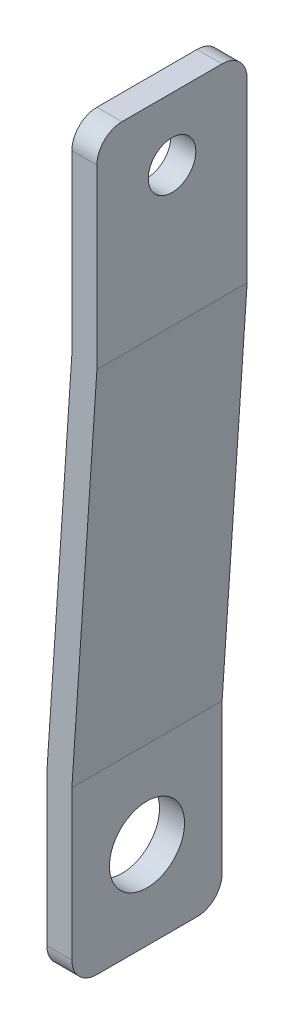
from build123d import *

# Parameters (mm, degrees)
EXTRU_MINCE3_DEPTH      = 60
CONG_1_R                = 10
ESQUISSE2_R             = 15
ESQUISSE2_R_2           = 9.5
ENL_V_MAT_EXTRU_1_DEPTH = 307.594194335


with BuildPart() as part:
    # Esquisse1 → Extru.-Mince3 (new body)
    with BuildSketch(Plane.XY):
        Polygon((0, 0), (0, -80.333704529), (-10, -230), (-10, -300), (0, -300), (0, -230.333704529), (10, -80.667409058), (10, 0), align=None)
    extrude(amount=EXTRU_MINCE3_DEPTH)

    # Cong_1
    cong_1_edges = [part.edges().sort_by_distance(p)[0] for p in [
        (5, 0, 60),
        (5, 0, 0),
        (-5, -300, 60),
        (-5, -300, 0),
    ]]
    fillet(cong_1_edges, radius=CONG_1_R)

    # Esquisse2 → Enl_v. mat.-Extru.1 (cut, through all)
    with BuildSketch(Plane(origin=(10, 0, 0), x_dir=(0, 0, -1), z_dir=(1, 0, 0))):
        with Locations(Location((-30, -265, 0), (0, 0, 90))):
            Circle(ESQUISSE2_R)
        with Locations(Location((-30, -25, 0), (0, 0, 90))):
            Circle(ESQUISSE2_R_2)
    extrude(amount=-ENL_V_MAT_EXTRU_1_DEPTH, mode=Mode.SUBTRACT)


solid = part.part
